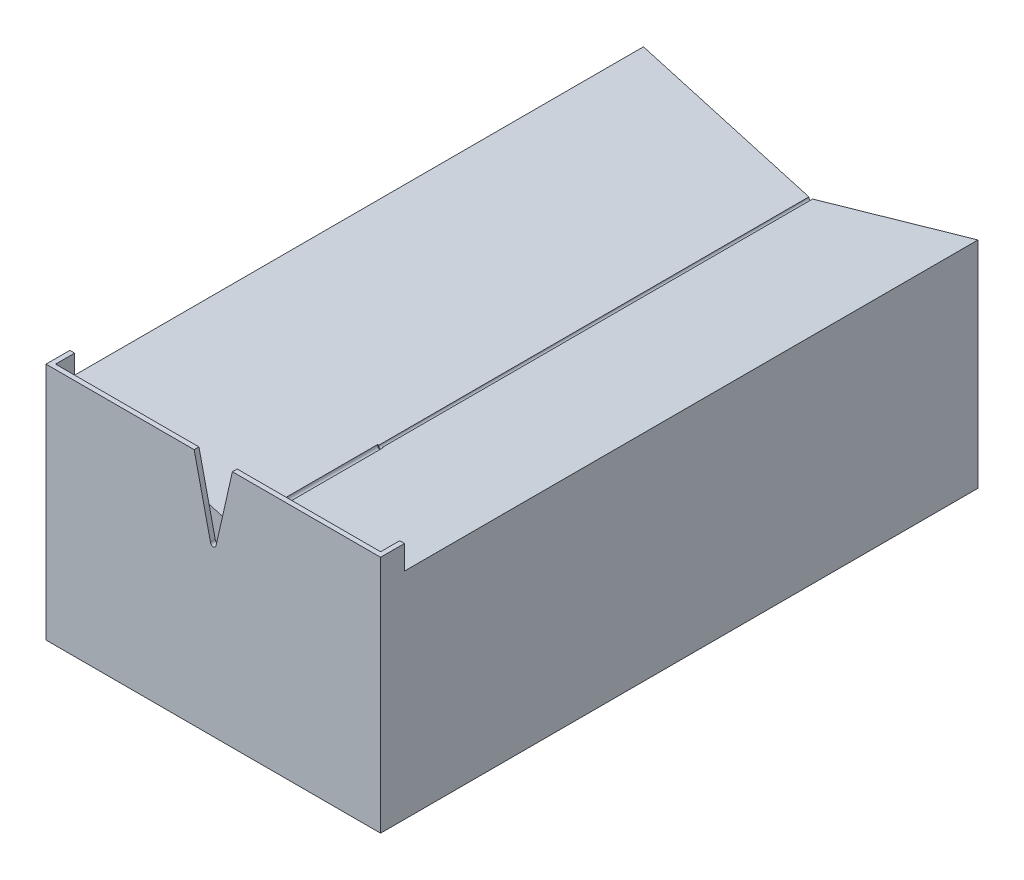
ISO-10303-21;
HEADER;
FILE_DESCRIPTION(('STEP AP214'),'2;1');
FILE_NAME('part.step','',(''),(''),'','','');
FILE_SCHEMA(('AUTOMOTIVE_DESIGN { 1 0 10303 214 1 1 1 1 }'));
ENDSEC;
DATA;
#1=APPLICATION_CONTEXT('core data for automotive mechanical design processes');
#2=APPLICATION_PROTOCOL_DEFINITION('international standard','automotive_design',2000,#1);
#3=PRODUCT_CONTEXT('',#1,'mechanical');
#4=PRODUCT('Part','Part','',(#3));
#5=PRODUCT_RELATED_PRODUCT_CATEGORY('part','',(#4));
#6=PRODUCT_DEFINITION_FORMATION('','',#4);
#7=PRODUCT_DEFINITION_CONTEXT('part definition',#1,'design');
#8=PRODUCT_DEFINITION('design','',#6,#7);
#9=PRODUCT_DEFINITION_SHAPE('','',#8);
#10=(LENGTH_UNIT() NAMED_UNIT(*) SI_UNIT(.MILLI.,.METRE.));
#11=(NAMED_UNIT(*) PLANE_ANGLE_UNIT() SI_UNIT($,.RADIAN.));
#12=(NAMED_UNIT(*) SI_UNIT($,.STERADIAN.) SOLID_ANGLE_UNIT());
#13=UNCERTAINTY_MEASURE_WITH_UNIT(LENGTH_MEASURE(1.E-05),#10,'distance_accuracy_value','');
#14=(GEOMETRIC_REPRESENTATION_CONTEXT(3) GLOBAL_UNCERTAINTY_ASSIGNED_CONTEXT((#13)) GLOBAL_UNIT_ASSIGNED_CONTEXT((#10,
#11,#12)) REPRESENTATION_CONTEXT('',''));
#15=CARTESIAN_POINT('',(0.,0.,0.));
#16=DIRECTION('',(0.,0.,1.));
#17=DIRECTION('',(1.,0.,0.));
#18=AXIS2_PLACEMENT_3D('',#15,#16,#17);
#19=CARTESIAN_POINT('',(-35.,27.5,125.));
#20=DIRECTION('',(0.,-1.,0.));
#21=DIRECTION('',(0.,0.,-1.));
#22=AXIS2_PLACEMENT_3D('',#19,#20,#21);
#23=PLANE('',#22);
#24=DIRECTION('',(-1.,0.,0.));
#25=VECTOR('',#24,1.);
#26=CARTESIAN_POINT('',(-35.,27.5,125.));
#27=LINE('',#26,#25);
#28=CARTESIAN_POINT('',(-4.,27.5,125.));
#29=VERTEX_POINT('',#28);
#30=CARTESIAN_POINT('',(-35.,27.5,125.));
#31=VERTEX_POINT('',#30);
#32=EDGE_CURVE('E245',#29,#31,#27,.T.);
#33=ORIENTED_EDGE('',*,*,#32,.F.);
#34=DIRECTION('',(0.,0.,1.));
#35=VECTOR('',#34,1.);
#36=CARTESIAN_POINT('',(-4.,27.5,121.));
#37=LINE('',#36,#35);
#38=CARTESIAN_POINT('',(-4.,27.5,124.));
#39=VERTEX_POINT('',#38);
#40=EDGE_CURVE('E335',#39,#29,#37,.T.);
#41=ORIENTED_EDGE('',*,*,#40,.F.);
#42=DIRECTION('',(1.,0.,0.));
#43=VECTOR('',#42,1.);
#44=CARTESIAN_POINT('',(34.,27.5,124.));
#45=LINE('',#44,#43);
#46=CARTESIAN_POINT('',(-34.,27.5,124.));
#47=VERTEX_POINT('',#46);
#48=EDGE_CURVE('E216',#47,#39,#45,.T.);
#49=ORIENTED_EDGE('',*,*,#48,.F.);
#50=DIRECTION('',(0.,0.,1.));
#51=VECTOR('',#50,1.);
#52=CARTESIAN_POINT('',(-34.,27.5,124.));
#53=LINE('',#52,#51);
#54=CARTESIAN_POINT('',(-34.,27.5,120.));
#55=VERTEX_POINT('',#54);
#56=EDGE_CURVE('E199',#55,#47,#53,.T.);
#57=ORIENTED_EDGE('',*,*,#56,.F.);
#58=DIRECTION('',(-1.,0.,0.));
#59=VECTOR('',#58,1.);
#60=CARTESIAN_POINT('',(-35.,27.5,120.));
#61=LINE('',#60,#59);
#62=CARTESIAN_POINT('',(-35.,27.5,120.));
#63=VERTEX_POINT('',#62);
#64=EDGE_CURVE('E252',#55,#63,#61,.T.);
#65=ORIENTED_EDGE('',*,*,#64,.T.);
#66=DIRECTION('',(0.,0.,-1.));
#67=VECTOR('',#66,1.);
#68=CARTESIAN_POINT('',(-35.,27.5,125.));
#69=LINE('',#68,#67);
#70=EDGE_CURVE('E247',#31,#63,#69,.T.);
#71=ORIENTED_EDGE('',*,*,#70,.F.);
#72=EDGE_LOOP('',(#33,#41,#49,#57,#65,#71));
#73=FACE_BOUND('',#72,.T.);
#74=ADVANCED_FACE('F32',(#73),#23,.F.);
#75=CARTESIAN_POINT('',(0.,12.5,120.));
#76=DIRECTION('',(0.,0.,-1.));
#77=DIRECTION('',(-1.,0.,0.));
#78=AXIS2_PLACEMENT_3D('',#75,#76,#77);
#79=CYLINDRICAL_SURFACE('',#78,0.399999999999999);
#80=CARTESIAN_POINT('',(0.,12.5,90.));
#81=DIRECTION('',(0.,0.,1.));
#82=DIRECTION('',(1.,0.,0.));
#83=AXIS2_PLACEMENT_3D('',#80,#81,#82);
#84=CIRCLE('',#83,0.399999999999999);
#85=CARTESIAN_POINT('',(0.384609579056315,12.6098884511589,90.));
#86=VERTEX_POINT('',#85);
#87=CARTESIAN_POINT('',(-0.384609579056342,12.6098884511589,90.));
#88=VERTEX_POINT('',#87);
#89=EDGE_CURVE('E167',#86,#88,#84,.F.);
#90=ORIENTED_EDGE('',*,*,#89,.F.);
#91=DIRECTION('',(0.,0.,-1.));
#92=VECTOR('',#91,1.);
#93=CARTESIAN_POINT('',(0.384609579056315,12.6098884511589,120.));
#94=LINE('',#93,#92);
#95=CARTESIAN_POINT('',(0.384609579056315,12.6098884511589,0.));
#96=VERTEX_POINT('',#95);
#97=EDGE_CURVE('E283',#86,#96,#94,.T.);
#98=ORIENTED_EDGE('',*,*,#97,.T.);
#99=CARTESIAN_POINT('',(0.,12.5,0.));
#100=DIRECTION('',(0.,0.,-1.));
#101=DIRECTION('',(1.,0.,0.));
#102=AXIS2_PLACEMENT_3D('',#99,#100,#101);
#103=CIRCLE('',#102,0.399999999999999);
#104=CARTESIAN_POINT('',(-0.384609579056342,12.6098884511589,0.));
#105=VERTEX_POINT('',#104);
#106=EDGE_CURVE('E279',#96,#105,#103,.T.);
#107=ORIENTED_EDGE('',*,*,#106,.T.);
#108=DIRECTION('',(0.,0.,-1.));
#109=VECTOR('',#108,1.);
#110=CARTESIAN_POINT('',(-0.384609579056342,12.6098884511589,120.));
#111=LINE('',#110,#109);
#112=EDGE_CURVE('E267',#88,#105,#111,.T.);
#113=ORIENTED_EDGE('',*,*,#112,.F.);
#114=EDGE_LOOP('',(#90,#98,#107,#113));
#115=FACE_BOUND('',#114,.T.);
#116=ADVANCED_FACE('F309',(#115),#79,.F.);
#117=CARTESIAN_POINT('',(0.,0.,120.));
#118=DIRECTION('',(0.,0.,-1.));
#119=DIRECTION('',(-1.,0.,0.));
#120=AXIS2_PLACEMENT_3D('',#117,#118,#119);
#121=PLANE('',#120);
#122=DIRECTION('',(0.,1.,0.));
#123=VECTOR('',#122,1.);
#124=CARTESIAN_POINT('',(-34.,-20.5,120.));
#125=LINE('',#124,#123);
#126=CARTESIAN_POINT('',(-34.,22.2142857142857,120.));
#127=VERTEX_POINT('',#126);
#128=EDGE_CURVE('E224',#127,#55,#125,.T.);
#129=ORIENTED_EDGE('',*,*,#128,.F.);
#130=DIRECTION('',(-0.961523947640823,0.274721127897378,0.));
#131=VECTOR('',#130,1.);
#132=CARTESIAN_POINT('',(-35.,22.5,120.));
#133=LINE('',#132,#131);
#134=CARTESIAN_POINT('',(-35.,22.5,120.));
#135=VERTEX_POINT('',#134);
#136=EDGE_CURVE('E264',#127,#135,#133,.T.);
#137=ORIENTED_EDGE('',*,*,#136,.T.);
#138=DIRECTION('',(0.,-1.,0.));
#139=VECTOR('',#138,1.);
#140=CARTESIAN_POINT('',(-35.,-22.5,120.));
#141=LINE('',#140,#139);
#142=EDGE_CURVE('E235',#63,#135,#141,.T.);
#143=ORIENTED_EDGE('',*,*,#142,.F.);
#144=ORIENTED_EDGE('',*,*,#64,.F.);
#145=EDGE_LOOP('',(#129,#137,#143,#144));
#146=FACE_BOUND('',#145,.T.);
#147=ADVANCED_FACE('F326',(#146),#121,.T.);
#148=CARTESIAN_POINT('',(-35.,22.5,120.));
#149=DIRECTION('',(-0.274721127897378,-0.961523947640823,0.));
#150=DIRECTION('',(0.961523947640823,-0.274721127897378,0.));
#151=AXIS2_PLACEMENT_3D('',#148,#149,#150);
#152=PLANE('',#151);
#153=CARTESIAN_POINT('',(-0.576914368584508,12.6648326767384,120.));
#154=VERTEX_POINT('',#153);
#155=EDGE_CURVE('E261',#154,#127,#133,.T.);
#156=ORIENTED_EDGE('',*,*,#155,.F.);
#157=DIRECTION('',(0.,0.,1.));
#158=VECTOR('',#157,1.);
#159=CARTESIAN_POINT('',(-0.576914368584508,12.6648326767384,90.));
#160=LINE('',#159,#158);
#161=CARTESIAN_POINT('',(-0.576914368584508,12.6648326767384,90.));
#162=VERTEX_POINT('',#161);
#163=EDGE_CURVE('E192',#154,#162,#160,.F.);
#164=ORIENTED_EDGE('',*,*,#163,.T.);
#165=DIRECTION('',(-0.961523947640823,0.274721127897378,0.));
#166=VECTOR('',#165,1.);
#167=CARTESIAN_POINT('',(-35.,22.5,90.));
#168=LINE('',#167,#166);
#169=EDGE_CURVE('E197',#88,#162,#168,.T.);
#170=ORIENTED_EDGE('',*,*,#169,.F.);
#171=ORIENTED_EDGE('',*,*,#112,.T.);
#172=DIRECTION('',(-0.961523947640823,0.274721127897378,0.));
#173=VECTOR('',#172,1.);
#174=CARTESIAN_POINT('',(-35.,22.5,0.));
#175=LINE('',#174,#173);
#176=CARTESIAN_POINT('',(-35.,22.5,0.));
#177=VERTEX_POINT('',#176);
#178=EDGE_CURVE('E260',#105,#177,#175,.T.);
#179=ORIENTED_EDGE('',*,*,#178,.T.);
#180=DIRECTION('',(0.,0.,-1.));
#181=VECTOR('',#180,1.);
#182=CARTESIAN_POINT('',(-35.,22.5,120.));
#183=LINE('',#182,#181);
#184=EDGE_CURVE('E294',#135,#177,#183,.T.);
#185=ORIENTED_EDGE('',*,*,#184,.F.);
#186=ORIENTED_EDGE('',*,*,#136,.F.);
#187=EDGE_LOOP('',(#156,#164,#170,#171,#179,#185,#186));
#188=FACE_BOUND('',#187,.T.);
#189=ADVANCED_FACE('F34',(#188),#152,.F.);
#190=CARTESIAN_POINT('',(-35.,-22.5,120.));
#191=DIRECTION('',(1.,0.,0.));
#192=DIRECTION('',(0.,0.,-1.));
#193=AXIS2_PLACEMENT_3D('',#190,#191,#192);
#194=PLANE('',#193);
#195=DIRECTION('',(0.,-1.,0.));
#196=VECTOR('',#195,1.);
#197=CARTESIAN_POINT('',(-35.,-22.5,0.));
#198=LINE('',#197,#196);
#199=CARTESIAN_POINT('',(-35.,-22.5,0.));
#200=VERTEX_POINT('',#199);
#201=EDGE_CURVE('E270',#177,#200,#198,.T.);
#202=ORIENTED_EDGE('',*,*,#201,.T.);
#203=DIRECTION('',(0.,0.,-1.));
#204=VECTOR('',#203,1.);
#205=CARTESIAN_POINT('',(-35.,-22.5,120.));
#206=LINE('',#205,#204);
#207=CARTESIAN_POINT('',(-35.,-22.5,125.));
#208=VERTEX_POINT('',#207);
#209=EDGE_CURVE('E291',#208,#200,#206,.T.);
#210=ORIENTED_EDGE('',*,*,#209,.F.);
#211=DIRECTION('',(0.,-1.,0.));
#212=VECTOR('',#211,1.);
#213=CARTESIAN_POINT('',(-35.,-22.5,125.));
#214=LINE('',#213,#212);
#215=EDGE_CURVE('E236',#31,#208,#214,.T.);
#216=ORIENTED_EDGE('',*,*,#215,.F.);
#217=ORIENTED_EDGE('',*,*,#70,.T.);
#218=ORIENTED_EDGE('',*,*,#142,.T.);
#219=ORIENTED_EDGE('',*,*,#184,.T.);
#220=EDGE_LOOP('',(#202,#210,#216,#217,#218,#219));
#221=FACE_BOUND('',#220,.T.);
#222=ADVANCED_FACE('F320',(#221),#194,.F.);
#223=CARTESIAN_POINT('',(35.,-22.5,120.));
#224=DIRECTION('',(0.,1.,0.));
#225=DIRECTION('',(-1.,0.,0.));
#226=AXIS2_PLACEMENT_3D('',#223,#224,#225);
#227=PLANE('',#226);
#228=DIRECTION('',(1.,0.,0.));
#229=VECTOR('',#228,1.);
#230=CARTESIAN_POINT('',(35.,-22.5,0.));
#231=LINE('',#230,#229);
#232=CARTESIAN_POINT('',(35.,-22.5,0.));
#233=VERTEX_POINT('',#232);
#234=EDGE_CURVE('E272',#200,#233,#231,.T.);
#235=ORIENTED_EDGE('',*,*,#234,.T.);
#236=DIRECTION('',(0.,0.,-1.));
#237=VECTOR('',#236,1.);
#238=CARTESIAN_POINT('',(35.,-22.5,120.));
#239=LINE('',#238,#237);
#240=CARTESIAN_POINT('',(35.,-22.5,125.));
#241=VERTEX_POINT('',#240);
#242=EDGE_CURVE('E288',#241,#233,#239,.T.);
#243=ORIENTED_EDGE('',*,*,#242,.F.);
#244=DIRECTION('',(1.,0.,0.));
#245=VECTOR('',#244,1.);
#246=CARTESIAN_POINT('',(-35.,-22.5,125.));
#247=LINE('',#246,#245);
#248=EDGE_CURVE('E239',#208,#241,#247,.T.);
#249=ORIENTED_EDGE('',*,*,#248,.F.);
#250=ORIENTED_EDGE('',*,*,#209,.T.);
#251=EDGE_LOOP('',(#235,#243,#249,#250));
#252=FACE_BOUND('',#251,.T.);
#253=ADVANCED_FACE('F359',(#252),#227,.F.);
#254=CARTESIAN_POINT('',(35.,-22.5,120.));
#255=DIRECTION('',(-1.,0.,0.));
#256=DIRECTION('',(0.,0.,1.));
#257=AXIS2_PLACEMENT_3D('',#254,#255,#256);
#258=PLANE('',#257);
#259=DIRECTION('',(0.,1.,0.));
#260=VECTOR('',#259,1.);
#261=CARTESIAN_POINT('',(35.,-22.5,0.));
#262=LINE('',#261,#260);
#263=CARTESIAN_POINT('',(35.,22.5,0.));
#264=VERTEX_POINT('',#263);
#265=EDGE_CURVE('E274',#233,#264,#262,.T.);
#266=ORIENTED_EDGE('',*,*,#265,.T.);
#267=DIRECTION('',(0.,0.,-1.));
#268=VECTOR('',#267,1.);
#269=CARTESIAN_POINT('',(35.,22.5,120.));
#270=LINE('',#269,#268);
#271=CARTESIAN_POINT('',(35.,22.5,120.));
#272=VERTEX_POINT('',#271);
#273=EDGE_CURVE('E285',#272,#264,#270,.T.);
#274=ORIENTED_EDGE('',*,*,#273,.F.);
#275=DIRECTION('',(0.,1.,0.));
#276=VECTOR('',#275,1.);
#277=CARTESIAN_POINT('',(35.,-22.5,120.));
#278=LINE('',#277,#276);
#279=CARTESIAN_POINT('',(35.,27.5,120.));
#280=VERTEX_POINT('',#279);
#281=EDGE_CURVE('E250',#272,#280,#278,.T.);
#282=ORIENTED_EDGE('',*,*,#281,.T.);
#283=DIRECTION('',(0.,0.,-1.));
#284=VECTOR('',#283,1.);
#285=CARTESIAN_POINT('',(35.,27.5,125.));
#286=LINE('',#285,#284);
#287=CARTESIAN_POINT('',(35.,27.5,125.));
#288=VERTEX_POINT('',#287);
#289=EDGE_CURVE('E257',#288,#280,#286,.T.);
#290=ORIENTED_EDGE('',*,*,#289,.F.);
#291=DIRECTION('',(0.,1.,0.));
#292=VECTOR('',#291,1.);
#293=CARTESIAN_POINT('',(35.,-22.5,125.));
#294=LINE('',#293,#292);
#295=EDGE_CURVE('E243',#241,#288,#294,.T.);
#296=ORIENTED_EDGE('',*,*,#295,.F.);
#297=ORIENTED_EDGE('',*,*,#242,.T.);
#298=EDGE_LOOP('',(#266,#274,#282,#290,#296,#297));
#299=FACE_BOUND('',#298,.T.);
#300=ADVANCED_FACE('F354',(#299),#258,.F.);
#301=CARTESIAN_POINT('',(0.384609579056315,12.6098884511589,120.));
#302=DIRECTION('',(0.274721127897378,-0.961523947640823,0.));
#303=DIRECTION('',(0.961523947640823,0.274721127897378,0.));
#304=AXIS2_PLACEMENT_3D('',#301,#302,#303);
#305=PLANE('',#304);
#306=DIRECTION('',(-0.961523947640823,-0.274721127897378,0.));
#307=VECTOR('',#306,1.);
#308=CARTESIAN_POINT('',(0.384609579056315,12.6098884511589,90.));
#309=LINE('',#308,#307);
#310=CARTESIAN_POINT('',(0.57691436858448,12.6648326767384,90.));
#311=VERTEX_POINT('',#310);
#312=EDGE_CURVE('E195',#311,#86,#309,.T.);
#313=ORIENTED_EDGE('',*,*,#312,.F.);
#314=DIRECTION('',(0.,0.,1.));
#315=VECTOR('',#314,1.);
#316=CARTESIAN_POINT('',(0.57691436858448,12.6648326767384,90.));
#317=LINE('',#316,#315);
#318=CARTESIAN_POINT('',(0.57691436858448,12.6648326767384,120.));
#319=VERTEX_POINT('',#318);
#320=EDGE_CURVE('E189',#311,#319,#317,.T.);
#321=ORIENTED_EDGE('',*,*,#320,.T.);
#322=DIRECTION('',(0.961523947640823,0.274721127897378,0.));
#323=VECTOR('',#322,1.);
#324=CARTESIAN_POINT('',(0.384609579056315,12.6098884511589,120.));
#325=LINE('',#324,#323);
#326=CARTESIAN_POINT('',(34.,22.2142857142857,120.));
#327=VERTEX_POINT('',#326);
#328=EDGE_CURVE('E223',#319,#327,#325,.T.);
#329=ORIENTED_EDGE('',*,*,#328,.T.);
#330=DIRECTION('',(-0.961523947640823,-0.274721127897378,0.));
#331=VECTOR('',#330,1.);
#332=CARTESIAN_POINT('',(0.384609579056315,12.6098884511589,120.));
#333=LINE('',#332,#331);
#334=EDGE_CURVE('E263',#272,#327,#333,.T.);
#335=ORIENTED_EDGE('',*,*,#334,.F.);
#336=ORIENTED_EDGE('',*,*,#273,.T.);
#337=DIRECTION('',(-0.961523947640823,-0.274721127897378,0.));
#338=VECTOR('',#337,1.);
#339=CARTESIAN_POINT('',(0.384609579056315,12.6098884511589,0.));
#340=LINE('',#339,#338);
#341=EDGE_CURVE('E276',#264,#96,#340,.T.);
#342=ORIENTED_EDGE('',*,*,#341,.T.);
#343=ORIENTED_EDGE('',*,*,#97,.F.);
#344=EDGE_LOOP('',(#313,#321,#329,#335,#336,#342,#343));
#345=FACE_BOUND('',#344,.T.);
#346=ADVANCED_FACE('F349',(#345),#305,.F.);
#347=CARTESIAN_POINT('',(0.,12.5,0.));
#348=DIRECTION('',(0.,0.,1.));
#349=DIRECTION('',(1.,0.,0.));
#350=AXIS2_PLACEMENT_3D('',#347,#348,#349);
#351=PLANE('',#350);
#352=ORIENTED_EDGE('',*,*,#178,.F.);
#353=ORIENTED_EDGE('',*,*,#106,.F.);
#354=ORIENTED_EDGE('',*,*,#341,.F.);
#355=ORIENTED_EDGE('',*,*,#265,.F.);
#356=ORIENTED_EDGE('',*,*,#234,.F.);
#357=ORIENTED_EDGE('',*,*,#201,.F.);
#358=EDGE_LOOP('',(#352,#353,#354,#355,#356,#357));
#359=FACE_BOUND('',#358,.T.);
#360=ADVANCED_FACE('F314',(#359),#351,.F.);
#361=DIRECTION('',(0.,1.,0.));
#362=VECTOR('',#361,1.);
#363=CARTESIAN_POINT('',(34.,-20.5,120.));
#364=LINE('',#363,#362);
#365=CARTESIAN_POINT('',(34.,27.5,120.));
#366=VERTEX_POINT('',#365);
#367=EDGE_CURVE('E228',#327,#366,#364,.T.);
#368=ORIENTED_EDGE('',*,*,#367,.T.);
#369=EDGE_CURVE('E240',#280,#366,#61,.T.);
#370=ORIENTED_EDGE('',*,*,#369,.F.);
#371=ORIENTED_EDGE('',*,*,#281,.F.);
#372=ORIENTED_EDGE('',*,*,#334,.T.);
#373=EDGE_LOOP('',(#368,#370,#371,#372));
#374=FACE_BOUND('',#373,.T.);
#375=ADVANCED_FACE('F374',(#374),#121,.T.);
#376=CARTESIAN_POINT('',(4.,27.5,124.));
#377=VERTEX_POINT('',#376);
#378=CARTESIAN_POINT('',(34.,27.5,124.));
#379=VERTEX_POINT('',#378);
#380=EDGE_CURVE('E215',#377,#379,#45,.T.);
#381=ORIENTED_EDGE('',*,*,#380,.F.);
#382=DIRECTION('',(0.,0.,1.));
#383=VECTOR('',#382,1.);
#384=CARTESIAN_POINT('',(4.,27.5,121.));
#385=LINE('',#384,#383);
#386=CARTESIAN_POINT('',(4.,27.5,125.));
#387=VERTEX_POINT('',#386);
#388=EDGE_CURVE('E360',#377,#387,#385,.T.);
#389=ORIENTED_EDGE('',*,*,#388,.T.);
#390=EDGE_CURVE('E174',#288,#387,#27,.T.);
#391=ORIENTED_EDGE('',*,*,#390,.F.);
#392=ORIENTED_EDGE('',*,*,#289,.T.);
#393=ORIENTED_EDGE('',*,*,#369,.T.);
#394=DIRECTION('',(0.,0.,-1.));
#395=VECTOR('',#394,1.);
#396=CARTESIAN_POINT('',(34.,27.5,124.));
#397=LINE('',#396,#395);
#398=EDGE_CURVE('E204',#379,#366,#397,.T.);
#399=ORIENTED_EDGE('',*,*,#398,.F.);
#400=EDGE_LOOP('',(#381,#389,#391,#392,#393,#399));
#401=FACE_BOUND('',#400,.T.);
#402=ADVANCED_FACE('F368',(#401),#23,.F.);
#403=CARTESIAN_POINT('',(0.,0.,125.));
#404=DIRECTION('',(0.,0.,-1.));
#405=DIRECTION('',(-1.,0.,0.));
#406=AXIS2_PLACEMENT_3D('',#403,#404,#405);
#407=PLANE('',#406);
#408=CARTESIAN_POINT('',(0.,12.5,125.));
#409=DIRECTION('',(0.,0.,1.));
#410=DIRECTION('',(1.,0.,0.));
#411=AXIS2_PLACEMENT_3D('',#408,#409,#410);
#412=CIRCLE('',#411,0.6);
#413=CARTESIAN_POINT('',(-0.600000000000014,12.5,125.));
#414=VERTEX_POINT('',#413);
#415=CARTESIAN_POINT('',(0.599999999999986,12.5,125.));
#416=VERTEX_POINT('',#415);
#417=EDGE_CURVE('E172',#414,#416,#412,.T.);
#418=ORIENTED_EDGE('',*,*,#417,.F.);
#419=DIRECTION('',(0.221059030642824,-0.97526042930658,0.));
#420=VECTOR('',#419,1.);
#421=CARTESIAN_POINT('',(-0.600000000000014,12.5,125.));
#422=LINE('',#421,#420);
#423=EDGE_CURVE('E55',#29,#414,#422,.T.);
#424=ORIENTED_EDGE('',*,*,#423,.F.);
#425=ORIENTED_EDGE('',*,*,#32,.T.);
#426=ORIENTED_EDGE('',*,*,#215,.T.);
#427=ORIENTED_EDGE('',*,*,#248,.T.);
#428=ORIENTED_EDGE('',*,*,#295,.T.);
#429=ORIENTED_EDGE('',*,*,#390,.T.);
#430=DIRECTION('',(0.221059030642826,0.97526042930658,0.));
#431=VECTOR('',#430,1.);
#432=CARTESIAN_POINT('',(0.599999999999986,12.5,125.));
#433=LINE('',#432,#431);
#434=EDGE_CURVE('E161',#416,#387,#433,.T.);
#435=ORIENTED_EDGE('',*,*,#434,.F.);
#436=EDGE_LOOP('',(#418,#424,#425,#426,#427,#428,#429,#435));
#437=FACE_BOUND('',#436,.T.);
#438=ADVANCED_FACE('F171',(#437),#407,.F.);
#439=CARTESIAN_POINT('',(-34.,-20.5,120.));
#440=DIRECTION('',(0.,0.,-1.));
#441=DIRECTION('',(-1.,0.,0.));
#442=AXIS2_PLACEMENT_3D('',#439,#440,#441);
#443=PLANE('',#442);
#444=ORIENTED_EDGE('',*,*,#328,.F.);
#445=CARTESIAN_POINT('',(0.,12.5,120.));
#446=DIRECTION('',(0.,0.,-1.));
#447=DIRECTION('',(-1.,0.,0.));
#448=AXIS2_PLACEMENT_3D('',#445,#446,#447);
#449=CIRCLE('',#448,0.6);
#450=EDGE_CURVE('E186',#319,#154,#449,.T.);
#451=ORIENTED_EDGE('',*,*,#450,.T.);
#452=ORIENTED_EDGE('',*,*,#155,.T.);
#453=CARTESIAN_POINT('',(-34.,-20.5,120.));
#454=VERTEX_POINT('',#453);
#455=EDGE_CURVE('E220',#454,#127,#125,.T.);
#456=ORIENTED_EDGE('',*,*,#455,.F.);
#457=DIRECTION('',(-1.,0.,0.));
#458=VECTOR('',#457,1.);
#459=CARTESIAN_POINT('',(-34.,-20.5,120.));
#460=LINE('',#459,#458);
#461=CARTESIAN_POINT('',(34.,-20.5,120.));
#462=VERTEX_POINT('',#461);
#463=EDGE_CURVE('E210',#462,#454,#460,.T.);
#464=ORIENTED_EDGE('',*,*,#463,.F.);
#465=EDGE_CURVE('E225',#462,#327,#364,.T.);
#466=ORIENTED_EDGE('',*,*,#465,.T.);
#467=EDGE_LOOP('',(#444,#451,#452,#456,#464,#466));
#468=FACE_BOUND('',#467,.T.);
#469=ADVANCED_FACE('F345',(#468),#443,.F.);
#470=CARTESIAN_POINT('',(-34.,-20.5,124.));
#471=DIRECTION('',(-1.,0.,0.));
#472=DIRECTION('',(0.,0.,1.));
#473=AXIS2_PLACEMENT_3D('',#470,#471,#472);
#474=PLANE('',#473);
#475=ORIENTED_EDGE('',*,*,#56,.T.);
#476=DIRECTION('',(0.,1.,0.));
#477=VECTOR('',#476,1.);
#478=CARTESIAN_POINT('',(-34.,-20.5,124.));
#479=LINE('',#478,#477);
#480=CARTESIAN_POINT('',(-34.,-20.5,124.));
#481=VERTEX_POINT('',#480);
#482=EDGE_CURVE('E213',#481,#47,#479,.T.);
#483=ORIENTED_EDGE('',*,*,#482,.F.);
#484=DIRECTION('',(0.,0.,1.));
#485=VECTOR('',#484,1.);
#486=CARTESIAN_POINT('',(-34.,-20.5,124.));
#487=LINE('',#486,#485);
#488=EDGE_CURVE('E200',#454,#481,#487,.T.);
#489=ORIENTED_EDGE('',*,*,#488,.F.);
#490=ORIENTED_EDGE('',*,*,#455,.T.);
#491=ORIENTED_EDGE('',*,*,#128,.T.);
#492=EDGE_LOOP('',(#475,#483,#489,#490,#491));
#493=FACE_BOUND('',#492,.T.);
#494=ADVANCED_FACE('F329',(#493),#474,.F.);
#495=CARTESIAN_POINT('',(34.,-20.5,124.));
#496=DIRECTION('',(1.,0.,0.));
#497=DIRECTION('',(0.,0.,-1.));
#498=AXIS2_PLACEMENT_3D('',#495,#496,#497);
#499=PLANE('',#498);
#500=ORIENTED_EDGE('',*,*,#398,.T.);
#501=ORIENTED_EDGE('',*,*,#367,.F.);
#502=ORIENTED_EDGE('',*,*,#465,.F.);
#503=DIRECTION('',(0.,0.,-1.));
#504=VECTOR('',#503,1.);
#505=CARTESIAN_POINT('',(34.,-20.5,124.));
#506=LINE('',#505,#504);
#507=CARTESIAN_POINT('',(34.,-20.5,124.));
#508=VERTEX_POINT('',#507);
#509=EDGE_CURVE('E207',#508,#462,#506,.T.);
#510=ORIENTED_EDGE('',*,*,#509,.F.);
#511=DIRECTION('',(0.,1.,0.));
#512=VECTOR('',#511,1.);
#513=CARTESIAN_POINT('',(34.,-20.5,124.));
#514=LINE('',#513,#512);
#515=EDGE_CURVE('E229',#508,#379,#514,.T.);
#516=ORIENTED_EDGE('',*,*,#515,.T.);
#517=EDGE_LOOP('',(#500,#501,#502,#510,#516));
#518=FACE_BOUND('',#517,.T.);
#519=ADVANCED_FACE('F372',(#518),#499,.F.);
#520=CARTESIAN_POINT('',(34.,-20.5,124.));
#521=DIRECTION('',(0.,0.,1.));
#522=DIRECTION('',(1.,0.,0.));
#523=AXIS2_PLACEMENT_3D('',#520,#521,#522);
#524=PLANE('',#523);
#525=ORIENTED_EDGE('',*,*,#48,.T.);
#526=DIRECTION('',(0.221059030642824,-0.97526042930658,0.));
#527=VECTOR('',#526,1.);
#528=CARTESIAN_POINT('',(8.20527561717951,-26.3468041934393,124.));
#529=LINE('',#528,#527);
#530=CARTESIAN_POINT('',(-0.600000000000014,12.5,124.));
#531=VERTEX_POINT('',#530);
#532=EDGE_CURVE('E178',#39,#531,#529,.T.);
#533=ORIENTED_EDGE('',*,*,#532,.T.);
#534=CARTESIAN_POINT('',(0.,12.5,124.));
#535=DIRECTION('',(0.,0.,1.));
#536=DIRECTION('',(1.,0.,0.));
#537=AXIS2_PLACEMENT_3D('',#534,#535,#536);
#538=CIRCLE('',#537,0.6);
#539=CARTESIAN_POINT('',(0.599999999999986,12.5,124.));
#540=VERTEX_POINT('',#539);
#541=EDGE_CURVE('E181',#531,#540,#538,.T.);
#542=ORIENTED_EDGE('',*,*,#541,.T.);
#543=DIRECTION('',(0.221059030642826,0.97526042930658,0.));
#544=VECTOR('',#543,1.);
#545=CARTESIAN_POINT('',(-4.88231315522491,-11.6866756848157,124.));
#546=LINE('',#545,#544);
#547=EDGE_CURVE('E47',#540,#377,#546,.T.);
#548=ORIENTED_EDGE('',*,*,#547,.T.);
#549=ORIENTED_EDGE('',*,*,#380,.T.);
#550=ORIENTED_EDGE('',*,*,#515,.F.);
#551=DIRECTION('',(1.,0.,0.));
#552=VECTOR('',#551,1.);
#553=CARTESIAN_POINT('',(34.,-20.5,124.));
#554=LINE('',#553,#552);
#555=EDGE_CURVE('E203',#481,#508,#554,.T.);
#556=ORIENTED_EDGE('',*,*,#555,.F.);
#557=ORIENTED_EDGE('',*,*,#482,.T.);
#558=EDGE_LOOP('',(#525,#533,#542,#548,#549,#550,#556,#557));
#559=FACE_BOUND('',#558,.T.);
#560=ADVANCED_FACE('F337',(#559),#524,.F.);
#561=CARTESIAN_POINT('',(0.,-20.5,0.));
#562=DIRECTION('',(0.,-1.,0.));
#563=DIRECTION('',(0.,0.,-1.));
#564=AXIS2_PLACEMENT_3D('',#561,#562,#563);
#565=PLANE('',#564);
#566=ORIENTED_EDGE('',*,*,#488,.T.);
#567=ORIENTED_EDGE('',*,*,#555,.T.);
#568=ORIENTED_EDGE('',*,*,#509,.T.);
#569=ORIENTED_EDGE('',*,*,#463,.T.);
#570=EDGE_LOOP('',(#566,#567,#568,#569));
#571=FACE_BOUND('',#570,.T.);
#572=ADVANCED_FACE('F341',(#571),#565,.F.);
#573=CARTESIAN_POINT('',(0.,12.5,90.));
#574=DIRECTION('',(0.,0.,1.));
#575=DIRECTION('',(1.,0.,0.));
#576=AXIS2_PLACEMENT_3D('',#573,#574,#575);
#577=CYLINDRICAL_SURFACE('',#576,0.6);
#578=ORIENTED_EDGE('',*,*,#541,.F.);
#579=DIRECTION('',(0.,0.,1.));
#580=VECTOR('',#579,1.);
#581=CARTESIAN_POINT('',(-0.600000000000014,12.5,90.));
#582=LINE('',#581,#580);
#583=EDGE_CURVE('E11',#531,#414,#582,.T.);
#584=ORIENTED_EDGE('',*,*,#583,.T.);
#585=ORIENTED_EDGE('',*,*,#417,.T.);
#586=DIRECTION('',(0.,0.,1.));
#587=VECTOR('',#586,1.);
#588=CARTESIAN_POINT('',(0.599999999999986,12.5,90.));
#589=LINE('',#588,#587);
#590=EDGE_CURVE('E40',#416,#540,#589,.F.);
#591=ORIENTED_EDGE('',*,*,#590,.T.);
#592=EDGE_LOOP('',(#578,#584,#585,#591));
#593=FACE_BOUND('',#592,.T.);
#594=ADVANCED_FACE('F176',(#593),#577,.F.);
#595=CARTESIAN_POINT('',(0.,12.5,90.));
#596=DIRECTION('',(0.,0.,1.));
#597=DIRECTION('',(1.,0.,0.));
#598=AXIS2_PLACEMENT_3D('',#595,#596,#597);
#599=PLANE('',#598);
#600=ORIENTED_EDGE('',*,*,#169,.T.);
#601=CARTESIAN_POINT('',(0.,12.5,90.));
#602=DIRECTION('',(0.,0.,1.));
#603=DIRECTION('',(1.,0.,0.));
#604=AXIS2_PLACEMENT_3D('',#601,#602,#603);
#605=CIRCLE('',#604,0.6);
#606=EDGE_CURVE('E177',#162,#311,#605,.T.);
#607=ORIENTED_EDGE('',*,*,#606,.T.);
#608=ORIENTED_EDGE('',*,*,#312,.T.);
#609=ORIENTED_EDGE('',*,*,#89,.T.);
#610=EDGE_LOOP('',(#600,#607,#608,#609));
#611=FACE_BOUND('',#610,.T.);
#612=ADVANCED_FACE('F301',(#611),#599,.T.);
#613=ORIENTED_EDGE('',*,*,#450,.F.);
#614=ORIENTED_EDGE('',*,*,#320,.F.);
#615=ORIENTED_EDGE('',*,*,#606,.F.);
#616=ORIENTED_EDGE('',*,*,#163,.F.);
#617=EDGE_LOOP('',(#613,#614,#615,#616));
#618=FACE_BOUND('',#617,.T.);
#619=ADVANCED_FACE('F347',(#618),#577,.F.);
#620=CARTESIAN_POINT('',(0.599999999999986,12.5,121.));
#621=DIRECTION('',(0.97526042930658,-0.221059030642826,0.));
#622=DIRECTION('',(0.221059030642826,0.97526042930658,0.));
#623=AXIS2_PLACEMENT_3D('',#620,#621,#622);
#624=PLANE('',#623);
#625=ORIENTED_EDGE('',*,*,#590,.F.);
#626=ORIENTED_EDGE('',*,*,#434,.T.);
#627=ORIENTED_EDGE('',*,*,#388,.F.);
#628=ORIENTED_EDGE('',*,*,#547,.F.);
#629=EDGE_LOOP('',(#625,#626,#627,#628));
#630=FACE_BOUND('',#629,.T.);
#631=ADVANCED_FACE('F160',(#630),#624,.F.);
#632=CARTESIAN_POINT('',(-0.600000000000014,12.5,121.));
#633=DIRECTION('',(-0.97526042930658,-0.221059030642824,0.));
#634=DIRECTION('',(0.221059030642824,-0.97526042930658,0.));
#635=AXIS2_PLACEMENT_3D('',#632,#633,#634);
#636=PLANE('',#635);
#637=ORIENTED_EDGE('',*,*,#40,.T.);
#638=ORIENTED_EDGE('',*,*,#423,.T.);
#639=ORIENTED_EDGE('',*,*,#583,.F.);
#640=ORIENTED_EDGE('',*,*,#532,.F.);
#641=EDGE_LOOP('',(#637,#638,#639,#640));
#642=FACE_BOUND('',#641,.T.);
#643=ADVANCED_FACE('F502',(#642),#636,.F.);
#644=CLOSED_SHELL('',(#74,#116,#147,#189,#222,#253,#300,#346,#360,#375,#402,#438,#469,#494,#519,
#560,#572,#594,#612,#619,#631,#643));
#645=MANIFOLD_SOLID_BREP('B2',#644);
#646=ADVANCED_BREP_SHAPE_REPRESENTATION('',(#18,#645),#14);
#647=SHAPE_DEFINITION_REPRESENTATION(#9,#646);
ENDSEC;
END-ISO-10303-21;
